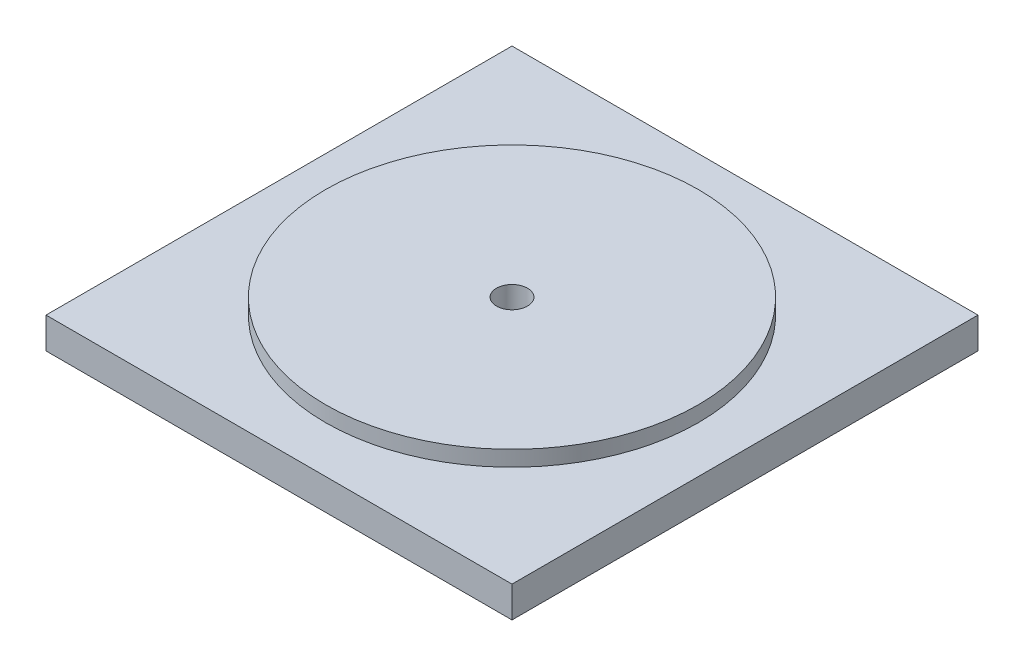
from build123d import *

# Parameters (mm, degrees)
SKETCH1_W           = 150
SKETCH1_H           = 150
BOSS_EXTRUDE1_DEPTH = 10
SKETCH2_R           = 60
BOSS_EXTRUDE2_DEPTH = 5
SKETCH3_R           = 5
CUT_EXTRUDE1_DEPTH  = 108.121426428


with BuildPart() as part:
    # Sketch1 → Boss-Extrude1 (new body)
    with BuildSketch(Plane(origin=(0, 0, 0), x_dir=(1, 0, 0), z_dir=(0, 1, 0))):
        Rectangle(SKETCH1_W, SKETCH1_H)
    extrude(amount=-BOSS_EXTRUDE1_DEPTH)

    # Sketch2 → Boss-Extrude2 (add)
    with BuildSketch(Plane(origin=(0, 0, 0), x_dir=(1, 0, 0), z_dir=(0, 1, 0))):
        with Locations(Location((0, 0, 0), (0, 0, 270))):
            Circle(SKETCH2_R)
    extrude(amount=BOSS_EXTRUDE2_DEPTH)

    # Sketch3 → Cut-Extrude1 (cut, through all)
    with BuildSketch(Plane(origin=(0, 5, 0), x_dir=(1, 0, 0), z_dir=(0, 1, 0))):
        with Locations(Location((0, 0, 0), (0, 0, 270))):
            Circle(SKETCH3_R)
    extrude(amount=-CUT_EXTRUDE1_DEPTH, mode=Mode.SUBTRACT)


solid = part.part
